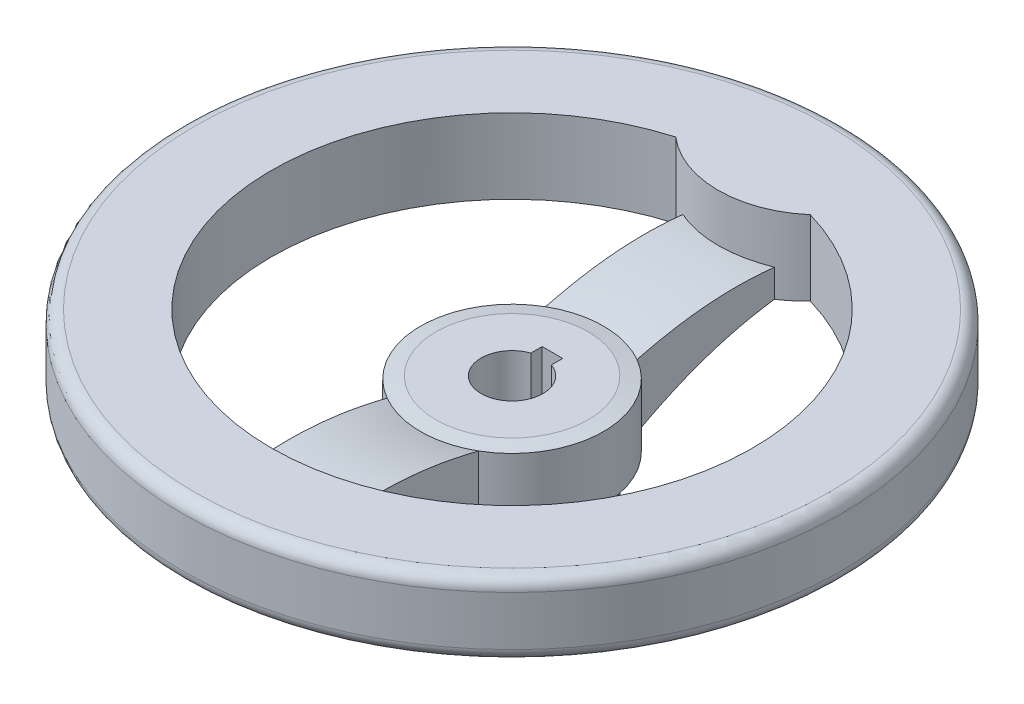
from build123d import *

# Parameters (mm, degrees)
CUT_EXTRUDE1_START  = 47
CUT_EXTRUDE1_DEPTH  = 47
CUT_EXTRUDE2_START  = 47
CUT_EXTRUDE2_DEPTH  = 47
CUT_EXTRUDE3_DEPTH  = 32
BOSS_EXTRUDE1_DEPTH = 21.6


with BuildPart() as part:
    # Sketch1 → Revolve1 (revolve)
    with BuildSketch(Plane.XY, mode=Mode.PRIVATE) as revolve1_sk:
        with BuildLine():
            Line((0, 32), (18.5, 32))
            Line((18.5, 32), (22.2, 31.36))
            ThreePointArc((22.2, 31.36), (40.182906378, 34.457837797), (58.4, 33.4))
            Line((58.4, 33.4), (58.4, 46))
            Line((58.4, 46), (77, 46))
            ThreePointArc((77, 46), (79.121320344, 45.121320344), (80, 43))
            Line((80, 43), (80, 31))
            ThreePointArc((80, 31), (79.121320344, 28.878679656), (77, 28))
            Line((77, 28), (62, 28))
            ThreePointArc((62, 28), (39.193572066, 23.960998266), (18.5, 13.557981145))
            Line((18.5, 13.557981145), (18.5, 0))
            Line((18.5, 0), (0, 0))
            Line((0, 0), (0, 32))
        make_face()
    revolve(revolve1_sk.sketch.rotate(Axis((0, 0, 0), (0, 1, 0)), 270), axis=Axis((0, 0, 0), (0, 1, 0)))

    # Sketch2 → Cut-Extrude1 (cut)
    with BuildSketch(Plane(origin=(0, 0, 0), x_dir=(1, 0, 0), z_dir=(0, 1, 0)).offset(CUT_EXTRUDE1_START)):
        with BuildLine():
            Line((-11.1, -57.335416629), (-11.1, -19.225763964))
            ThreePointArc((-11.1, -19.225763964), (-22.2, 0), (-11.1, 19.225763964))
            Line((-11.1, 19.225763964), (-11.1, 57.335416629))
            ThreePointArc((-11.1, 57.335416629), (-58.4, 0), (-11.1, -57.335416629))
        make_face()
    extrude(amount=-CUT_EXTRUDE1_DEPTH, mode=Mode.SUBTRACT)

    # Sketch3 → Cut-Extrude2 (cut)
    with BuildSketch(Plane(origin=(0, 0, 0), x_dir=(1, 0, 0), z_dir=(0, 1, 0)).offset(CUT_EXTRUDE2_START)):
        with BuildLine():
            Line((11.1, 57.335416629), (11.1, 19.225763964))
            ThreePointArc((11.1, 19.225763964), (22.2, 0), (11.1, -19.225763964))
            Line((11.1, -19.225763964), (11.1, -57.335416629))
            ThreePointArc((11.1, -57.335416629), (58.4, 0), (11.1, 57.335416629))
        make_face()
    extrude(amount=-CUT_EXTRUDE2_DEPTH, mode=Mode.SUBTRACT)

    # Sketch4 → Cut-Extrude3 (cut)
    with BuildSketch(Plane(origin=(0, 0, 0), x_dir=(1, 0, 0), z_dir=(0, 1, 0))):
        with BuildLine():
            Line((2.5, 7.071067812), (2.5, 9.8))
            Line((2.5, 9.8), (-2.5, 9.8))
            Line((-2.5, 9.8), (-2.5, 7.071067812))
            ThreePointArc((-2.5, 7.071067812), (0, -7.5), (2.5, 7.071067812))
        make_face()
    extrude(amount=CUT_EXTRUDE3_DEPTH, mode=Mode.SUBTRACT)

    # Sketch5 → Cut-Revolve1 (revolve, cut)
    with BuildSketch(Plane(origin=(0, 0, 0), x_dir=(0, 0, -1), z_dir=(1, 0, 0)), mode=Mode.PRIVATE) as cut_revolve1_sk:
        Polygon((7, 8), (7, 10.067), (18.067, 10.067), (18.5, 10.5), (18.5, 8), align=None)
    revolve(cut_revolve1_sk.sketch.rotate(Axis((0, 8, -18.5), (0, 0, 1)), 135.148708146), axis=Axis((0, 8, -18.5), (0, 0, 1)), mode=Mode.SUBTRACT)

    # Sketch6 → Boss-Extrude1 (add)
    with BuildSketch(Plane(origin=(0, 46, 0), x_dir=(1, 0, 0), z_dir=(0, 1, 0))):
        with BuildLine():
            ThreePointArc((-17.847295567, 57.4936), (0, 50), (17.847295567, 57.4936))
            ThreePointArc((17.847295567, 57.4936), (0, 60.2), (-17.847295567, 57.4936))
        make_face()
    extrude(amount=-BOSS_EXTRUDE1_DEPTH)

    # Sketch7 → Cut-Revolve2 (revolve, cut)
    with BuildSketch(Plane.XY, mode=Mode.PRIVATE) as cut_revolve2_sk:
        with BuildLine():
            Line((18.5, 0), (80, 0))
            Line((80, 0), (80, 31))
            ThreePointArc((80, 31), (79.121320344, 28.878679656), (77, 28))
            Line((77, 28), (62, 28))
            ThreePointArc((62, 28), (41.306951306, 24.63027817), (22.2, 16))
            Line((22.2, 16), (18.5, 9.591412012))
            Line((18.5, 9.591412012), (18.5, 0))
        make_face()
    revolve(cut_revolve2_sk.sketch.rotate(Axis((0, 0, 0), (0, 1, 0)), 270), axis=Axis((0, 0, 0), (0, 1, 0)), mode=Mode.SUBTRACT)


solid = part.part
